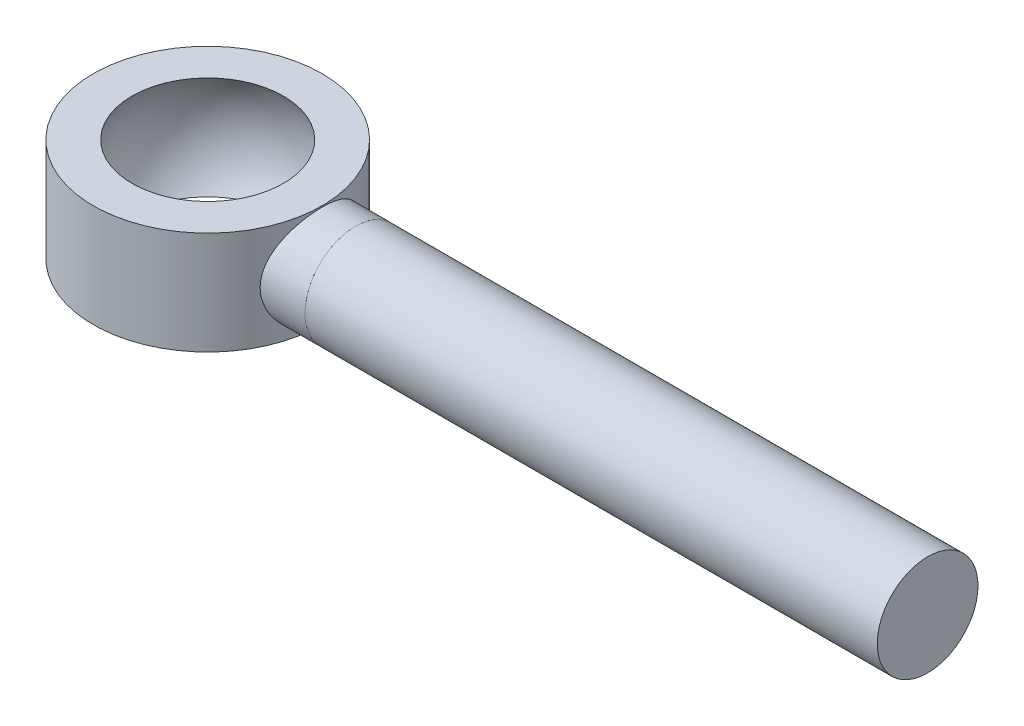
ISO-10303-21;
HEADER;
FILE_DESCRIPTION(('STEP AP214'),'2;1');
FILE_NAME('part.step','',(''),(''),'','','');
FILE_SCHEMA(('AUTOMOTIVE_DESIGN { 1 0 10303 214 1 1 1 1 }'));
ENDSEC;
DATA;
#1=APPLICATION_CONTEXT('core data for automotive mechanical design processes');
#2=APPLICATION_PROTOCOL_DEFINITION('international standard','automotive_design',2000,#1);
#3=PRODUCT_CONTEXT('',#1,'mechanical');
#4=PRODUCT('Part','Part','',(#3));
#5=PRODUCT_RELATED_PRODUCT_CATEGORY('part','',(#4));
#6=PRODUCT_DEFINITION_FORMATION('','',#4);
#7=PRODUCT_DEFINITION_CONTEXT('part definition',#1,'design');
#8=PRODUCT_DEFINITION('design','',#6,#7);
#9=PRODUCT_DEFINITION_SHAPE('','',#8);
#10=(LENGTH_UNIT() NAMED_UNIT(*) SI_UNIT(.MILLI.,.METRE.));
#11=(NAMED_UNIT(*) PLANE_ANGLE_UNIT() SI_UNIT($,.RADIAN.));
#12=(NAMED_UNIT(*) SI_UNIT($,.STERADIAN.) SOLID_ANGLE_UNIT());
#13=UNCERTAINTY_MEASURE_WITH_UNIT(LENGTH_MEASURE(1.E-05),#10,'distance_accuracy_value','');
#14=(GEOMETRIC_REPRESENTATION_CONTEXT(3) GLOBAL_UNCERTAINTY_ASSIGNED_CONTEXT((#13)) GLOBAL_UNIT_ASSIGNED_CONTEXT((#10,
#11,#12)) REPRESENTATION_CONTEXT('',''));
#15=CARTESIAN_POINT('',(0.,0.,0.));
#16=DIRECTION('',(0.,0.,1.));
#17=DIRECTION('',(1.,0.,0.));
#18=AXIS2_PLACEMENT_3D('',#15,#16,#17);
#19=CARTESIAN_POINT('',(-150.,0.,0.));
#20=DIRECTION('',(-1.,0.,0.));
#21=DIRECTION('',(0.,0.,1.));
#22=AXIS2_PLACEMENT_3D('',#19,#20,#21);
#23=CYLINDRICAL_SURFACE('',#22,22.);
#24=CARTESIAN_POINT('',(-150.,0.,0.));
#25=DIRECTION('',(1.,0.,0.));
#26=DIRECTION('',(0.,0.,-1.));
#27=AXIS2_PLACEMENT_3D('',#24,#25,#26);
#28=CIRCLE('',#27,22.);
#29=CARTESIAN_POINT('',(-150.,0.,-22.));
#30=VERTEX_POINT('',#29);
#31=EDGE_CURVE('E12',#30,#30,#28,.T.);
#32=ORIENTED_EDGE('',*,*,#31,.F.);
#33=EDGE_LOOP('',(#32));
#34=FACE_BOUND('',#33,.T.);
#35=CARTESIAN_POINT('',(-400.,0.,0.));
#36=DIRECTION('',(1.,0.,0.));
#37=DIRECTION('',(0.,0.,-1.));
#38=AXIS2_PLACEMENT_3D('',#35,#36,#37);
#39=CIRCLE('',#38,22.);
#40=CARTESIAN_POINT('',(-400.,0.,-22.));
#41=VERTEX_POINT('',#40);
#42=EDGE_CURVE('E47',#41,#41,#39,.T.);
#43=ORIENTED_EDGE('',*,*,#42,.T.);
#44=EDGE_LOOP('',(#43));
#45=FACE_BOUND('',#44,.T.);
#46=ADVANCED_FACE('F44',(#34,#45),#23,.T.);
#47=CARTESIAN_POINT('',(-150.,0.,0.));
#48=DIRECTION('',(1.,0.,0.));
#49=DIRECTION('',(0.,0.,-1.));
#50=AXIS2_PLACEMENT_3D('',#47,#48,#49);
#51=PLANE('',#50);
#52=ORIENTED_EDGE('',*,*,#31,.T.);
#53=EDGE_LOOP('',(#52));
#54=FACE_BOUND('',#53,.T.);
#55=ADVANCED_FACE('F59',(#54),#51,.T.);
#56=CARTESIAN_POINT('',(-400.,0.,0.));
#57=DIRECTION('',(1.,0.,0.));
#58=DIRECTION('',(0.,0.,-1.));
#59=AXIS2_PLACEMENT_3D('',#56,#57,#58);
#60=PLANE('',#59);
#61=ORIENTED_EDGE('',*,*,#42,.F.);
#62=EDGE_LOOP('',(#61));
#63=FACE_BOUND('',#62,.T.);
#64=ADVANCED_FACE('F57',(#63),#60,.F.);
#65=CLOSED_SHELL('',(#46,#55,#64));
#66=MANIFOLD_SOLID_BREP('B2',#65);
#67=CARTESIAN_POINT('',(-464.5,-22.5,0.));
#68=DIRECTION('',(0.,-1.,0.));
#69=DIRECTION('',(0.,0.,-1.));
#70=AXIS2_PLACEMENT_3D('',#67,#68,#69);
#71=CYLINDRICAL_SURFACE('',#70,50.);
#72=CARTESIAN_POINT('',(-464.5,-22.5,0.));
#73=DIRECTION('',(0.,-1.,0.));
#74=DIRECTION('',(0.,0.,-1.));
#75=AXIS2_PLACEMENT_3D('',#72,#73,#74);
#76=CIRCLE('',#75,50.);
#77=CARTESIAN_POINT('',(-464.5,-22.5,-50.));
#78=VERTEX_POINT('',#77);
#79=EDGE_CURVE('E106',#78,#78,#76,.T.);
#80=ORIENTED_EDGE('',*,*,#79,.F.);
#81=EDGE_LOOP('',(#80));
#82=FACE_BOUND('',#81,.T.);
#83=CARTESIAN_POINT('',(-464.5,22.5,0.));
#84=DIRECTION('',(0.,-1.,0.));
#85=DIRECTION('',(0.,0.,-1.));
#86=AXIS2_PLACEMENT_3D('',#83,#84,#85);
#87=CIRCLE('',#86,50.);
#88=CARTESIAN_POINT('',(-464.5,22.5,-50.));
#89=VERTEX_POINT('',#88);
#90=EDGE_CURVE('E111',#89,#89,#87,.T.);
#91=ORIENTED_EDGE('',*,*,#90,.T.);
#92=EDGE_LOOP('',(#91));
#93=FACE_BOUND('',#92,.T.);
#94=CARTESIAN_POINT('',(-419.600111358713,0.,-22.));
#95=CARTESIAN_POINT('',(-419.600103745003,0.36821249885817,-21.9999835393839));
#96=CARTESIAN_POINT('',(-419.595464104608,0.736402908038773,-21.9906181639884));
#97=CARTESIAN_POINT('',(-419.577236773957,1.47086978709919,-21.9535091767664));
#98=CARTESIAN_POINT('',(-419.563667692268,1.83714864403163,-21.9258037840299));
#99=CARTESIAN_POINT('',(-419.527962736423,2.56607773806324,-21.8524711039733));
#100=CARTESIAN_POINT('',(-419.50585952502,2.92873646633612,-21.806912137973));
#101=CARTESIAN_POINT('',(-419.453408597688,3.64870124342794,-21.6982075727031));
#102=CARTESIAN_POINT('',(-419.423108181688,4.0060259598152,-21.6351628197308));
#103=CARTESIAN_POINT('',(-419.354647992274,4.71482595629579,-21.4919367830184));
#104=CARTESIAN_POINT('',(-419.316522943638,5.06631990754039,-21.4118311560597));
#105=CARTESIAN_POINT('',(-419.23294879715,5.76418120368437,-21.2347100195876));
#106=CARTESIAN_POINT('',(-419.187498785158,6.11054790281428,-21.137692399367));
#107=CARTESIAN_POINT('',(-419.089669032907,6.79819116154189,-20.9266974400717));
#108=CARTESIAN_POINT('',(-419.037269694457,7.13945016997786,-20.8126720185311));
#109=CARTESIAN_POINT('',(-418.925971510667,7.8169339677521,-20.5676832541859));
#110=CARTESIAN_POINT('',(-418.867038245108,8.15312036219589,-20.436629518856));
#111=CARTESIAN_POINT('',(-418.743492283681,8.81847745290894,-20.1585040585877));
#112=CARTESIAN_POINT('',(-418.678869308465,9.14763405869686,-20.0114032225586));
#113=CARTESIAN_POINT('',(-418.54495097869,9.79666794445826,-19.7021554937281));
#114=CARTESIAN_POINT('',(-418.47566907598,10.1165684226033,-19.5400514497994));
#115=CARTESIAN_POINT('',(-418.33312149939,10.746807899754,-19.2010801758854));
#116=CARTESIAN_POINT('',(-418.259862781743,11.0571621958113,-19.0242384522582));
#117=CARTESIAN_POINT('',(-418.110054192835,11.668037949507,-18.6560894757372));
#118=CARTESIAN_POINT('',(-418.033506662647,11.9685661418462,-18.4647924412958));
#119=CARTESIAN_POINT('',(-417.877809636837,12.5595160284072,-18.0680235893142));
#120=CARTESIAN_POINT('',(-417.798659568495,12.8499354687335,-17.8625486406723));
#121=CARTESIAN_POINT('',(-417.638445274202,13.420395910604,-17.4377148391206));
#122=CARTESIAN_POINT('',(-417.557379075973,13.7004253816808,-17.2183412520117));
#123=CARTESIAN_POINT('',(-417.394019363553,14.2498314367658,-16.7659956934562));
#124=CARTESIAN_POINT('',(-417.311723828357,14.5191870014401,-16.5329989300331));
#125=CARTESIAN_POINT('',(-417.146588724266,15.0469804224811,-16.0537033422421));
#126=CARTESIAN_POINT('',(-417.063748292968,15.3053876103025,-15.8073710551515));
#127=CARTESIAN_POINT('',(-416.898590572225,15.8098342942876,-15.3028036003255));
#128=CARTESIAN_POINT('',(-416.816272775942,16.0558882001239,-15.0445830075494));
#129=CARTESIAN_POINT('',(-416.65309878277,16.5343287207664,-14.5173230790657));
#130=CARTESIAN_POINT('',(-416.572238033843,16.76676639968,-14.2483315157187));
#131=CARTESIAN_POINT('',(-416.412489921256,17.2180845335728,-13.6994880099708));
#132=CARTESIAN_POINT('',(-416.333599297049,17.4369884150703,-13.4196562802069));
#133=CARTESIAN_POINT('',(-416.178279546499,17.8614330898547,-12.8491451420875));
#134=CARTESIAN_POINT('',(-416.101851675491,18.0669671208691,-12.5584603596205));
#135=CARTESIAN_POINT('',(-415.951944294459,18.4647515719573,-11.965680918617));
#136=CARTESIAN_POINT('',(-415.878477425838,18.6569471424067,-11.6635462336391));
#137=CARTESIAN_POINT('',(-415.735155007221,19.0273619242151,-11.0485368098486));
#138=CARTESIAN_POINT('',(-415.66531259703,19.2055313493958,-10.7356290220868));
#139=CARTESIAN_POINT('',(-415.530083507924,19.5468398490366,-10.1008179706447));
#140=CARTESIAN_POINT('',(-415.464696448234,19.7099802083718,-9.77891547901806));
#141=CARTESIAN_POINT('',(-415.339187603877,20.0201228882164,-9.12782437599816));
#142=CARTESIAN_POINT('',(-415.279048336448,20.1671792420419,-8.79866492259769));
#143=CARTESIAN_POINT('',(-415.164804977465,20.4445682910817,-8.13313853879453));
#144=CARTESIAN_POINT('',(-415.11068895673,20.5749341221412,-7.7967874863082));
#145=CARTESIAN_POINT('',(-415.008718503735,20.8191808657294,-7.11674244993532));
#146=CARTESIAN_POINT('',(-414.960871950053,20.9330410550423,-6.77303984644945));
#147=CARTESIAN_POINT('',(-414.87170205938,21.1440085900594,-6.07946263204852));
#148=CARTESIAN_POINT('',(-414.830382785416,21.2411055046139,-5.72958432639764));
#149=CARTESIAN_POINT('',(-414.754591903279,21.4182360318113,-5.02480456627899));
#150=CARTESIAN_POINT('',(-414.720120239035,21.4982697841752,-4.66990315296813));
#151=CARTESIAN_POINT('',(-414.658331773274,21.6409749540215,-3.9562334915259));
#152=CARTESIAN_POINT('',(-414.63101063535,21.7036568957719,-3.59746772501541));
#153=CARTESIAN_POINT('',(-414.583838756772,21.8113542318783,-2.87722491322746));
#154=CARTESIAN_POINT('',(-414.563979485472,21.8563898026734,-2.51575144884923));
#155=CARTESIAN_POINT('',(-414.532031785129,21.9285004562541,-1.79125193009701));
#156=CARTESIAN_POINT('',(-414.519931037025,21.9556040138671,-1.42822926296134));
#157=CARTESIAN_POINT('',(-414.503852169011,21.9915252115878,-0.701785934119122));
#158=CARTESIAN_POINT('',(-414.499858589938,22.0003776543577,-0.338367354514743));
#159=CARTESIAN_POINT('',(-414.500154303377,21.999592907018,0.389317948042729));
#160=CARTESIAN_POINT('',(-414.504463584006,21.9899110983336,0.753584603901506));
#161=CARTESIAN_POINT('',(-414.52096819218,21.952496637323,1.48268950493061));
#162=CARTESIAN_POINT('',(-414.533199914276,21.9246806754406,1.84752259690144));
#163=CARTESIAN_POINT('',(-414.565416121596,21.8511506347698,2.57549285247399));
#164=CARTESIAN_POINT('',(-414.585410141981,21.8054145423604,2.9386273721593));
#165=CARTESIAN_POINT('',(-414.63301934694,21.6961077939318,3.66089675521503));
#166=CARTESIAN_POINT('',(-414.660617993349,21.6325758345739,4.02003855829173));
#167=CARTESIAN_POINT('',(-414.723138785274,21.4881374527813,4.73233559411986));
#168=CARTESIAN_POINT('',(-414.758024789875,21.4073167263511,5.08551140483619));
#169=CARTESIAN_POINT('',(-414.834588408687,21.2289066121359,5.78554223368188));
#170=CARTESIAN_POINT('',(-414.876242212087,21.1313759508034,6.13241483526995));
#171=CARTESIAN_POINT('',(-414.966044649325,20.9196150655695,6.81990252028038));
#172=CARTESIAN_POINT('',(-415.014188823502,20.8053963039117,7.16052171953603));
#173=CARTESIAN_POINT('',(-415.116590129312,20.5605540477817,7.83565111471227));
#174=CARTESIAN_POINT('',(-415.170859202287,20.4298984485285,8.17014784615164));
#175=CARTESIAN_POINT('',(-415.285311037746,20.1519494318,8.8331927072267));
#176=CARTESIAN_POINT('',(-415.345522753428,20.0045739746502,9.16170144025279));
#177=CARTESIAN_POINT('',(-415.471232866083,19.6936842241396,9.81160513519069));
#178=CARTESIAN_POINT('',(-415.536751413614,19.5301078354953,10.1329664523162));
#179=CARTESIAN_POINT('',(-415.672188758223,19.188027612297,10.7666951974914));
#180=CARTESIAN_POINT('',(-415.742107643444,19.0095234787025,11.0790624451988));
#181=CARTESIAN_POINT('',(-415.885514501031,18.6385935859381,11.6927911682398));
#182=CARTESIAN_POINT('',(-415.958986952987,18.44622683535,11.9941919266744));
#183=CARTESIAN_POINT('',(-416.108835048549,18.0482539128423,12.5853289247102));
#184=CARTESIAN_POINT('',(-416.185196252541,17.8427107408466,12.8751112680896));
#185=CARTESIAN_POINT('',(-416.340339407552,17.4183568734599,13.443804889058));
#186=CARTESIAN_POINT('',(-416.419119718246,17.1995550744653,13.7227232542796));
#187=CARTESIAN_POINT('',(-416.578606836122,16.7485432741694,14.269719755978));
#188=CARTESIAN_POINT('',(-416.659316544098,16.5163122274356,14.537779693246));
#189=CARTESIAN_POINT('',(-416.822151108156,16.0384241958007,15.0631899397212));
#190=CARTESIAN_POINT('',(-416.904280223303,15.7927188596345,15.3204949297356));
#191=CARTESIAN_POINT('',(-417.069131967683,15.2886644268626,15.8234869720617));
#192=CARTESIAN_POINT('',(-417.151855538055,15.0302869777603,16.0691453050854));
#193=CARTESIAN_POINT('',(-417.316899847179,14.501972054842,16.5475300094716));
#194=CARTESIAN_POINT('',(-417.399220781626,14.2320409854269,16.7802633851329));
#195=CARTESIAN_POINT('',(-417.56272581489,13.6811163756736,17.2324055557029));
#196=CARTESIAN_POINT('',(-417.643910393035,13.4001277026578,17.4518201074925));
#197=CARTESIAN_POINT('',(-417.804404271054,12.8275589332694,17.8769072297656));
#198=CARTESIAN_POINT('',(-417.883714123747,12.5359820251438,18.0825838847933));
#199=CARTESIAN_POINT('',(-418.039721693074,11.9427153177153,18.4797854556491));
#200=CARTESIAN_POINT('',(-418.116419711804,11.6410266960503,18.6713120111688));
#201=CARTESIAN_POINT('',(-418.266466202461,11.0280125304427,19.0398004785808));
#202=CARTESIAN_POINT('',(-418.339814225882,10.7166857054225,19.2167604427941));
#203=CARTESIAN_POINT('',(-418.482426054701,10.0848757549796,19.5557124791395));
#204=CARTESIAN_POINT('',(-418.551687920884,9.76438838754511,19.7176974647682));
#205=CARTESIAN_POINT('',(-418.685385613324,9.11472445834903,20.0262677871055));
#206=CARTESIAN_POINT('',(-418.749816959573,8.78554020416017,20.1728388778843));
#207=CARTESIAN_POINT('',(-418.872931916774,8.12013993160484,20.4497899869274));
#208=CARTESIAN_POINT('',(-418.931626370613,7.78393869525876,20.5802006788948));
#209=CARTESIAN_POINT('',(-419.042559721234,7.10576527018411,20.8242015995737));
#210=CARTESIAN_POINT('',(-419.094820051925,6.76381680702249,20.9378479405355));
#211=CARTESIAN_POINT('',(-419.192426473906,6.07407134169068,21.1482337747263));
#212=CARTESIAN_POINT('',(-419.237777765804,5.72627895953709,21.2449859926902));
#213=CARTESIAN_POINT('',(-419.321182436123,5.02480870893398,21.4216535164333));
#214=CARTESIAN_POINT('',(-419.359220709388,4.67112026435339,21.5015340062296));
#215=CARTESIAN_POINT('',(-419.427346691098,3.95809714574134,21.6439939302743));
#216=CARTESIAN_POINT('',(-419.457403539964,3.59874608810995,21.7065062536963));
#217=CARTESIAN_POINT('',(-419.509161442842,2.87624488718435,21.8137335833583));
#218=CARTESIAN_POINT('',(-419.530849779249,2.51308981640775,21.8584215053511));
#219=CARTESIAN_POINT('',(-419.565628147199,1.78525376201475,21.9298394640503));
#220=CARTESIAN_POINT('',(-419.57873317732,1.42057656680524,21.9566008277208));
#221=CARTESIAN_POINT('',(-419.596118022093,0.691945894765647,21.9919368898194));
#222=CARTESIAN_POINT('',(-419.600441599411,0.327997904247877,22.0006017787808));
#223=CARTESIAN_POINT('',(-419.59975320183,-0.398975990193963,21.9993410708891));
#224=CARTESIAN_POINT('',(-419.594763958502,-0.762001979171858,21.98946074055));
#225=CARTESIAN_POINT('',(-419.575760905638,-1.48760574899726,21.9514754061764));
#226=CARTESIAN_POINT('',(-419.561728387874,-1.85018103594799,21.9233326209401));
#227=CARTESIAN_POINT('',(-419.525156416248,-2.57365096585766,21.8492140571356));
#228=CARTESIAN_POINT('',(-419.502603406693,-2.93454199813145,21.8032098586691));
#229=CARTESIAN_POINT('',(-419.44942654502,-3.65340233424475,21.6937012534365));
#230=CARTESIAN_POINT('',(-419.418795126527,-4.01136857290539,21.6301804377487));
#231=CARTESIAN_POINT('',(-419.349919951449,-4.72313911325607,21.4859851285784));
#232=CARTESIAN_POINT('',(-419.31167509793,-5.0769428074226,21.4053081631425));
#233=CARTESIAN_POINT('',(-419.228018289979,-5.77914194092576,21.2271350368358));
#234=CARTESIAN_POINT('',(-419.182611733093,-6.12754123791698,21.1296515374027));
#235=CARTESIAN_POINT('',(-419.085104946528,-6.81769645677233,20.9182228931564));
#236=CARTESIAN_POINT('',(-419.033016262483,-7.15946269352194,20.8043061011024));
#237=CARTESIAN_POINT('',(-418.922519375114,-7.83506542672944,20.5602810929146));
#238=CARTESIAN_POINT('',(-418.864128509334,-8.16892074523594,20.4302171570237));
#239=CARTESIAN_POINT('',(-418.741474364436,-8.82919214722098,20.1538211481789));
#240=CARTESIAN_POINT('',(-418.677204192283,-9.15559892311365,20.0074699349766));
#241=CARTESIAN_POINT('',(-418.543663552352,-9.80157363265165,19.6988628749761));
#242=CARTESIAN_POINT('',(-418.474372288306,-10.1211050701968,19.5365397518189));
#243=CARTESIAN_POINT('',(-418.331561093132,-10.751979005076,19.1966009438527));
#244=CARTESIAN_POINT('',(-418.258031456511,-11.0633001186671,19.0189496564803));
#245=CARTESIAN_POINT('',(-418.107594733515,-11.676402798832,18.6489838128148));
#246=CARTESIAN_POINT('',(-418.030686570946,-11.9781812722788,18.45666456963));
#247=CARTESIAN_POINT('',(-417.874495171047,-12.5706511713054,18.0584667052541));
#248=CARTESIAN_POINT('',(-417.795219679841,-12.8613729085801,17.8526301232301));
#249=CARTESIAN_POINT('',(-417.635127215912,-13.4312157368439,17.4280846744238));
#250=CARTESIAN_POINT('',(-417.554316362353,-13.7103727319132,17.2094216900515));
#251=CARTESIAN_POINT('',(-417.39171001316,-14.2572125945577,16.7591768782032));
#252=CARTESIAN_POINT('',(-417.309915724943,-14.5249079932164,16.5276098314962));
#253=CARTESIAN_POINT('',(-417.145911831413,-15.0490779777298,16.0516509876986));
#254=CARTESIAN_POINT('',(-417.063701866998,-15.3055398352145,15.8072452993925));
#255=CARTESIAN_POINT('',(-416.899374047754,-15.8074306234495,15.3051806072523));
#256=CARTESIAN_POINT('',(-416.817257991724,-16.0528093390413,15.0474708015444));
#257=CARTESIAN_POINT('',(-416.653876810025,-16.5317660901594,14.519342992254));
#258=CARTESIAN_POINT('',(-416.572615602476,-16.7653004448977,14.2488841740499));
#259=CARTESIAN_POINT('',(-416.411905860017,-17.2193516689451,13.6967128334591));
#260=CARTESIAN_POINT('',(-416.332457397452,-17.4398680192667,13.4149998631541));
#261=CARTESIAN_POINT('',(-416.176362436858,-17.8665039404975,12.8416404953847));
#262=CARTESIAN_POINT('',(-416.099707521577,-18.0726688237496,12.550030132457));
#263=CARTESIAN_POINT('',(-415.949913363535,-18.4701280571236,11.9576008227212));
#264=CARTESIAN_POINT('',(-415.876762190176,-18.6614744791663,11.6568198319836));
#265=CARTESIAN_POINT('',(-415.734298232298,-19.0296646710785,11.0457545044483));
#266=CARTESIAN_POINT('',(-415.664984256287,-19.2065129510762,10.7354731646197));
#267=CARTESIAN_POINT('',(-415.530671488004,-19.5455060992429,10.1051776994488));
#268=CARTESIAN_POINT('',(-415.465682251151,-19.7076186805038,9.7851441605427));
#269=CARTESIAN_POINT('',(-415.340459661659,-20.0170613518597,9.13519118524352));
#270=CARTESIAN_POINT('',(-415.280250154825,-20.1643182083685,8.80523228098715));
#271=CARTESIAN_POINT('',(-415.165449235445,-20.4429492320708,8.13731265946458));
#272=CARTESIAN_POINT('',(-415.110863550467,-20.5743072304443,7.79934420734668));
#273=CARTESIAN_POINT('',(-415.008079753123,-20.8199377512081,7.11776141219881));
#274=CARTESIAN_POINT('',(-414.95985838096,-20.9342726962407,6.77417309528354));
#275=CARTESIAN_POINT('',(-414.870129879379,-21.1457354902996,6.08192285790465));
#276=CARTESIAN_POINT('',(-414.828604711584,-21.242909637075,5.73327742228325));
#277=CARTESIAN_POINT('',(-414.752568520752,-21.419993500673,5.03148989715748));
#278=CARTESIAN_POINT('',(-414.718045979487,-21.4999315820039,4.67835622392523));
#279=CARTESIAN_POINT('',(-414.656356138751,-21.6423881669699,3.96688706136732));
#280=CARTESIAN_POINT('',(-414.62921029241,-21.7048558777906,3.608539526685));
#281=CARTESIAN_POINT('',(-414.582425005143,-21.8122424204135,2.88719534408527));
#282=CARTESIAN_POINT('',(-414.562817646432,-21.857086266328,2.52418547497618));
#283=CARTESIAN_POINT('',(-414.531322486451,-21.9289494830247,1.79587774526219));
#284=CARTESIAN_POINT('',(-414.519438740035,-21.9559594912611,1.4305787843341));
#285=CARTESIAN_POINT('',(-414.503701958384,-21.9916561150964,0.700038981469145));
#286=CARTESIAN_POINT('',(-414.499824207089,-22.0003991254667,0.334801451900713));
#287=CARTESIAN_POINT('',(-414.500193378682,-21.9995609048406,-0.393821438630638));
#288=CARTESIAN_POINT('',(-414.504399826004,-21.9900709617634,-0.757206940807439));
#289=CARTESIAN_POINT('',(-414.520645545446,-21.9532167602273,-1.48193969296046));
#290=CARTESIAN_POINT('',(-414.532664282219,-21.9258993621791,-1.84328978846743));
#291=CARTESIAN_POINT('',(-414.564454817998,-21.8533532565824,-2.56395163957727));
#292=CARTESIAN_POINT('',(-414.584228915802,-21.8081192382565,-2.92326275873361));
#293=CARTESIAN_POINT('',(-414.631351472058,-21.6999421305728,-3.63987978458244));
#294=CARTESIAN_POINT('',(-414.658723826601,-21.6369431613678,-3.99717567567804));
#295=CARTESIAN_POINT('',(-414.72100333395,-21.4930783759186,-4.709213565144));
#296=CARTESIAN_POINT('',(-414.755944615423,-21.4121315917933,-5.06393621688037));
#297=CARTESIAN_POINT('',(-414.832905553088,-21.2327943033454,-5.76891430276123));
#298=CARTESIAN_POINT('',(-414.87493911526,-21.1343695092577,-6.11915947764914));
#299=CARTESIAN_POINT('',(-414.965458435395,-20.920938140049,-6.81316311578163));
#300=CARTESIAN_POINT('',(-415.013935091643,-20.8059549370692,-7.15692996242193));
#301=CARTESIAN_POINT('',(-415.116743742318,-20.5601497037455,-7.8359228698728));
#302=CARTESIAN_POINT('',(-415.171045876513,-20.4294080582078,-8.17118253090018));
#303=CARTESIAN_POINT('',(-415.285284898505,-20.1520500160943,-8.83308930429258));
#304=CARTESIAN_POINT('',(-415.345207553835,-20.0054735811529,-9.1597556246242));
#305=CARTESIAN_POINT('',(-415.470254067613,-19.6965471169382,-9.80539740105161));
#306=CARTESIAN_POINT('',(-415.53538879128,-19.5341639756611,-10.1243548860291));
#307=CARTESIAN_POINT('',(-415.670155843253,-19.1942207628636,-10.7538104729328));
#308=CARTESIAN_POINT('',(-415.739795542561,-19.0166356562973,-11.0642934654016));
#309=CARTESIAN_POINT('',(-415.882881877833,-18.6468894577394,-11.6760264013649));
#310=CARTESIAN_POINT('',(-415.956332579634,-18.4547126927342,-11.9772659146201));
#311=CARTESIAN_POINT('',(-416.106345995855,-18.0563818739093,-12.5697378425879));
#312=CARTESIAN_POINT('',(-416.182909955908,-17.8502222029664,-12.8609661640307));
#313=CARTESIAN_POINT('',(-416.338457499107,-17.4245217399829,-13.432636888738));
#314=CARTESIAN_POINT('',(-416.417440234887,-17.2049856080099,-13.7130829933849));
#315=CARTESIAN_POINT('',(-416.577123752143,-16.7531367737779,-14.2624195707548));
#316=CARTESIAN_POINT('',(-416.657822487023,-16.5208388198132,-14.5313227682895));
#317=CARTESIAN_POINT('',(-416.820265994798,-16.0440386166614,-15.0567631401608));
#318=CARTESIAN_POINT('',(-416.902008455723,-15.79956071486,-15.3133231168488));
#319=CARTESIAN_POINT('',(-417.06604697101,-15.2981962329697,-15.814309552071));
#320=CARTESIAN_POINT('',(-417.14834345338,-15.0412988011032,-16.0587250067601));
#321=CARTESIAN_POINT('',(-417.312849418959,-14.5151088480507,-16.535731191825));
#322=CARTESIAN_POINT('',(-417.395057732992,-14.2457784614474,-16.7682805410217));
#323=CARTESIAN_POINT('',(-417.558548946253,-13.6954912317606,-17.2206835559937));
#324=CARTESIAN_POINT('',(-417.639829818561,-13.4145135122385,-17.4405125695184));
#325=CARTESIAN_POINT('',(-417.800593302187,-12.8416953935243,-17.8665894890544));
#326=CARTESIAN_POINT('',(-417.880074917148,-12.5498492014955,-18.0728299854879));
#327=CARTESIAN_POINT('',(-418.036233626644,-11.9567542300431,-18.4706561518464));
#328=CARTESIAN_POINT('',(-418.112917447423,-11.655531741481,-18.6622783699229));
#329=CARTESIAN_POINT('',(-418.262681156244,-11.0445331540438,-19.0303689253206));
#330=CARTESIAN_POINT('',(-418.335772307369,-10.7347892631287,-19.2068861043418));
#331=CARTESIAN_POINT('',(-418.477783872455,-10.106607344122,-19.5447227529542));
#332=CARTESIAN_POINT('',(-418.546708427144,-9.78817841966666,-19.7060574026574));
#333=CARTESIAN_POINT('',(-418.679872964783,-9.14257558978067,-20.0136518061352));
#334=CARTESIAN_POINT('',(-418.744106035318,-8.81538971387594,-20.1598894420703));
#335=CARTESIAN_POINT('',(-418.867206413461,-8.15199624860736,-20.4370043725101));
#336=CARTESIAN_POINT('',(-418.926051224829,-7.81575780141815,-20.5678178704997));
#337=CARTESIAN_POINT('',(-419.037618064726,-7.13548642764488,-20.813339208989));
#338=CARTESIAN_POINT('',(-419.090324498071,-6.79143619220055,-20.9280061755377));
#339=CARTESIAN_POINT('',(-419.188890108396,-6.09763135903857,-21.1405691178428));
#340=CARTESIAN_POINT('',(-419.234756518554,-5.74788322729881,-21.2384828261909));
#341=CARTESIAN_POINT('',(-419.318820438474,-5.04469598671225,-21.4166470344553));
#342=CARTESIAN_POINT('',(-419.357051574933,-4.69128061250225,-21.4969751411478));
#343=CARTESIAN_POINT('',(-419.425330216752,-3.98158589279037,-21.6397998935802));
#344=CARTESIAN_POINT('',(-419.455410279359,-3.62532397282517,-21.7023675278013));
#345=CARTESIAN_POINT('',(-419.50735303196,-2.90936450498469,-21.8099951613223));
#346=CARTESIAN_POINT('',(-419.529211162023,-2.54966516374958,-21.8550454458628));
#347=CARTESIAN_POINT('',(-419.564412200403,-1.82675934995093,-21.927335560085));
#348=CARTESIAN_POINT('',(-419.577724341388,-1.46354493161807,-21.954511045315));
#349=CARTESIAN_POINT('',(-419.595613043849,-0.73355791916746,-21.9909218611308));
#350=CARTESIAN_POINT('',(-419.600130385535,-0.366777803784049,-22.0000355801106));
#351=CARTESIAN_POINT('',(-419.600111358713,0.,-22.));
#352=B_SPLINE_CURVE_WITH_KNOTS('',3,(#94,#95,#96,#97,#98,#99,#100,#101,#102,#103,#104,#105,#106,
#107,#108,#109,#110,#111,#112,#113,#114,#115,#116,#117,#118,#119,#120,#121,#122,#123,#124,#125,
#126,#127,#128,#129,#130,#131,#132,#133,#134,#135,#136,#137,#138,#139,#140,#141,#142,#143,#144,
#145,#146,#147,#148,#149,#150,#151,#152,#153,#154,#155,#156,#157,#158,#159,#160,#161,#162,#163,
#164,#165,#166,#167,#168,#169,#170,#171,#172,#173,#174,#175,#176,#177,#178,#179,#180,#181,#182,
#183,#184,#185,#186,#187,#188,#189,#190,#191,#192,#193,#194,#195,#196,#197,#198,#199,#200,#201,
#202,#203,#204,#205,#206,#207,#208,#209,#210,#211,#212,#213,#214,#215,#216,#217,#218,#219,#220,
#221,#222,#223,#224,#225,#226,#227,#228,#229,#230,#231,#232,#233,#234,#235,#236,#237,#238,#239,
#240,#241,#242,#243,#244,#245,#246,#247,#248,#249,#250,#251,#252,#253,#254,#255,#256,#257,#258,
#259,#260,#261,#262,#263,#264,#265,#266,#267,#268,#269,#270,#271,#272,#273,#274,#275,#276,#277,
#278,#279,#280,#281,#282,#283,#284,#285,#286,#287,#288,#289,#290,#291,#292,#293,#294,#295,#296,
#297,#298,#299,#300,#301,#302,#303,#304,#305,#306,#307,#308,#309,#310,#311,#312,#313,#314,#315,
#316,#317,#318,#319,#320,#321,#322,#323,#324,#325,#326,#327,#328,#329,#330,#331,#332,#333,#334,
#335,#336,#337,#338,#339,#340,#341,#342,#343,#344,#345,#346,#347,#348,#349,#350,#351),
.UNSPECIFIED.,.F.,.F.,(4,2,2,2,2,2,2,2,2,2,2,2,2,2,2,2,2,2,2,2,2,2,2,2,2,2,2,2,2,2,2,2,2,2,2,2,
2,2,2,2,2,2,2,2,2,2,2,2,2,2,2,2,2,2,2,2,2,2,2,2,2,2,2,2,2,2,2,2,2,2,2,2,2,2,2,2,2,2,2,2,2,2,2,2,
2,2,2,2,2,2,2,2,2,2,2,2,2,2,2,2,2,2,2,2,2,2,2,2,2,2,2,2,2,2,2,2,2,2,2,2,2,2,2,2,2,2,2,2,4),(0.,
1.10445792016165,2.20662145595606,3.30460782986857,4.39638891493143,5.48342569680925,
6.57059824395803,7.66090471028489,8.75725537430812,9.85562908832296,10.9509573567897,
12.0444278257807,13.1371324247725,14.2300791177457,15.3242045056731,16.4203870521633,
17.5194607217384,18.6172210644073,19.7105592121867,20.8019485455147,21.8938856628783,
22.9900752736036,24.0899951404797,25.1898208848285,26.2858303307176,27.3796289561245,
28.4747891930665,29.5706284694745,30.6664587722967,31.7616229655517,32.8555312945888,
33.9476983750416,35.0377808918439,36.1304909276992,37.2282566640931,38.3273751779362,
39.4241219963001,40.5155535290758,41.6032251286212,42.690153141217,43.7792381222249,
44.8739190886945,45.9729713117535,47.0720455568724,48.1666901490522,49.2564434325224,
50.3454734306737,51.4362589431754,52.531253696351,53.6288213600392,54.7257883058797,
55.8222776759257,56.9184395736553,58.0144742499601,59.1106552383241,60.207352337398,
61.3050542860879,62.4006397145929,63.4924705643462,64.5834754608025,65.6767101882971,
66.7741122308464,67.8731754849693,68.9703130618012,70.06196946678,71.1509647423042,
72.2422201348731,73.3352190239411,74.429245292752,75.5234293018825,76.6167925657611,
77.7082914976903,78.7968607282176,79.8867229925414,80.9813902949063,82.0786723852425,
83.1763065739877,84.2706754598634,85.3613436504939,86.4507872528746,87.54143492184,
88.6366097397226,89.7355667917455,90.8345676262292,91.9299243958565,93.0212387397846,
94.1122122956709,95.2055213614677,96.3039806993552,97.4035479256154,98.4989781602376,
99.5914063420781,100.682022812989,101.775777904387,102.874137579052,103.973073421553,
105.068611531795,106.15867884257,107.245892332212,108.333428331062,109.424424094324,
110.520445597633,111.618641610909,112.715302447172,113.806588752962,114.895182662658,
115.986108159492,117.078866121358,118.172814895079,119.267205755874,120.361217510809,
121.453990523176,122.544660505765,123.636301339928,124.731520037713,125.828794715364,
126.926662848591,128.021689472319,129.113029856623,130.203267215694,131.295079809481,
132.391260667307,133.490168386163,134.587905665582,135.680696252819,136.76905539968,
137.858017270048,138.950877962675,140.051072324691),.UNSPECIFIED.);
#353=CARTESIAN_POINT('',(-419.600111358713,0.,-22.));
#354=VERTEX_POINT('',#353);
#355=EDGE_CURVE('E43',#354,#354,#352,.T.);
#356=ORIENTED_EDGE('',*,*,#355,.F.);
#357=EDGE_LOOP('',(#356));
#358=FACE_BOUND('',#357,.T.);
#359=ADVANCED_FACE('F91',(#82,#93,#358),#71,.T.);
#360=CARTESIAN_POINT('',(-464.5,0.,0.));
#361=DIRECTION('',(0.,-1.,0.));
#362=DIRECTION('',(-1.,0.,0.));
#363=AXIS2_PLACEMENT_3D('',#360,#361,#362);
#364=SPHERICAL_SURFACE('',#363,40.0000000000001);
#365=CARTESIAN_POINT('',(-464.5,22.5,0.));
#366=DIRECTION('',(0.,-1.,0.));
#367=DIRECTION('',(0.,0.,-1.));
#368=AXIS2_PLACEMENT_3D('',#365,#366,#367);
#369=CIRCLE('',#368,33.0718913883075);
#370=CARTESIAN_POINT('',(-497.571891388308,22.5,0.));
#371=VERTEX_POINT('',#370);
#372=EDGE_CURVE('E146',#371,#371,#369,.T.);
#373=CARTESIAN_POINT('',(-464.5,-22.5,0.));
#374=DIRECTION('',(0.,-1.,0.));
#375=DIRECTION('',(0.,0.,-1.));
#376=AXIS2_PLACEMENT_3D('',#373,#374,#375);
#377=CIRCLE('',#376,33.0718913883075);
#378=CARTESIAN_POINT('',(-497.571891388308,-22.5,0.));
#379=VERTEX_POINT('',#378);
#380=EDGE_CURVE('E101',#379,#379,#377,.T.);
#381=CARTESIAN_POINT('',(-497.571891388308,22.5,0.));
#382=CARTESIAN_POINT('',(-497.851929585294,22.0883908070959,0.));
#383=CARTESIAN_POINT('',(-498.124275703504,21.671548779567,0.));
#384=CARTESIAN_POINT('',(-498.65322145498,20.827990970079,0.));
#385=CARTESIAN_POINT('',(-498.909821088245,20.4012751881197,0.));
#386=CARTESIAN_POINT('',(-499.406911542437,19.5385617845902,0.));
#387=CARTESIAN_POINT('',(-499.647402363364,19.1025641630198,0.));
#388=CARTESIAN_POINT('',(-500.11194120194,18.2218956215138,0.));
#389=CARTESIAN_POINT('',(-500.33598921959,17.7772247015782,0.));
#390=CARTESIAN_POINT('',(-500.767329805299,16.8798292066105,0.));
#391=CARTESIAN_POINT('',(-500.974622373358,16.4271046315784,0.));
#392=CARTESIAN_POINT('',(-501.372163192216,15.5142329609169,0.));
#393=CARTESIAN_POINT('',(-501.562411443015,15.0540858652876,0.));
#394=CARTESIAN_POINT('',(-501.925598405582,14.1270105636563,0.));
#395=CARTESIAN_POINT('',(-502.098537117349,13.6600823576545,0.));
#396=CARTESIAN_POINT('',(-502.426863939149,12.7200957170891,0.));
#397=CARTESIAN_POINT('',(-502.582252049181,12.2470372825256,0.));
#398=CARTESIAN_POINT('',(-502.875261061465,11.2954496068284,0.));
#399=CARTESIAN_POINT('',(-503.012881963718,10.8169203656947,0.));
#400=CARTESIAN_POINT('',(-503.270164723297,9.85505812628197,0.));
#401=CARTESIAN_POINT('',(-503.389826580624,9.37172512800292,0.));
#402=CARTESIAN_POINT('',(-503.611024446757,8.40092911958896,0.));
#403=CARTESIAN_POINT('',(-503.712560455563,7.91346610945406,0.));
#404=CARTESIAN_POINT('',(-503.897365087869,6.93508957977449,0.));
#405=CARTESIAN_POINT('',(-503.980633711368,6.44417606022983,0.));
#406=CARTESIAN_POINT('',(-504.128787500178,5.4595828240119,0.));
#407=CARTESIAN_POINT('',(-504.19367266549,4.96590310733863,0.));
#408=CARTESIAN_POINT('',(-504.304969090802,3.9764656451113,0.));
#409=CARTESIAN_POINT('',(-504.351380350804,3.48070789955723,0.));
#410=CARTESIAN_POINT('',(-504.425664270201,2.48780544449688,0.));
#411=CARTESIAN_POINT('',(-504.453536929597,1.99066073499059,0.));
#412=CARTESIAN_POINT('',(-504.490704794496,0.995677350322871,0.));
#413=CARTESIAN_POINT('',(-504.5,0.497838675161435,0.));
#414=CARTESIAN_POINT('',(-504.5,-0.497838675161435,0.));
#415=CARTESIAN_POINT('',(-504.490704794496,-0.995677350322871,0.));
#416=CARTESIAN_POINT('',(-504.453536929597,-1.99066073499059,0.));
#417=CARTESIAN_POINT('',(-504.425664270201,-2.48780544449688,0.));
#418=CARTESIAN_POINT('',(-504.351380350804,-3.48070789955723,0.));
#419=CARTESIAN_POINT('',(-504.304969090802,-3.9764656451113,0.));
#420=CARTESIAN_POINT('',(-504.19367266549,-4.96590310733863,0.));
#421=CARTESIAN_POINT('',(-504.128787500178,-5.4595828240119,0.));
#422=CARTESIAN_POINT('',(-503.980633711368,-6.44417606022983,0.));
#423=CARTESIAN_POINT('',(-503.897365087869,-6.93508957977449,0.));
#424=CARTESIAN_POINT('',(-503.712560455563,-7.91346610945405,0.));
#425=CARTESIAN_POINT('',(-503.611024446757,-8.40092911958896,0.));
#426=CARTESIAN_POINT('',(-503.389826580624,-9.37172512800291,0.));
#427=CARTESIAN_POINT('',(-503.270164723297,-9.85505812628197,0.));
#428=CARTESIAN_POINT('',(-503.012881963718,-10.8169203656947,0.));
#429=CARTESIAN_POINT('',(-502.875261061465,-11.2954496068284,0.));
#430=CARTESIAN_POINT('',(-502.582252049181,-12.2470372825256,0.));
#431=CARTESIAN_POINT('',(-502.426863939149,-12.7200957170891,0.));
#432=CARTESIAN_POINT('',(-502.098537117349,-13.6600823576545,0.));
#433=CARTESIAN_POINT('',(-501.925598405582,-14.1270105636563,0.));
#434=CARTESIAN_POINT('',(-501.562411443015,-15.0540858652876,0.));
#435=CARTESIAN_POINT('',(-501.372163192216,-15.5142329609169,0.));
#436=CARTESIAN_POINT('',(-500.974622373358,-16.4271046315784,0.));
#437=CARTESIAN_POINT('',(-500.767329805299,-16.8798292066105,0.));
#438=CARTESIAN_POINT('',(-500.33598921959,-17.7772247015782,0.));
#439=CARTESIAN_POINT('',(-500.11194120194,-18.2218956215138,0.));
#440=CARTESIAN_POINT('',(-499.647402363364,-19.1025641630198,0.));
#441=CARTESIAN_POINT('',(-499.406911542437,-19.5385617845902,0.));
#442=CARTESIAN_POINT('',(-498.909821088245,-20.4012751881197,0.));
#443=CARTESIAN_POINT('',(-498.65322145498,-20.827990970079,0.));
#444=CARTESIAN_POINT('',(-498.124275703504,-21.671548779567,0.));
#445=CARTESIAN_POINT('',(-497.851929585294,-22.0883908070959,0.));
#446=CARTESIAN_POINT('',(-497.571891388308,-22.5,0.));
#447=B_SPLINE_CURVE_WITH_KNOTS('',3,(#381,#382,#383,#384,#385,#386,#387,#388,#389,#390,#391,
#392,#393,#394,#395,#396,#397,#398,#399,#400,#401,#402,#403,#404,#405,#406,#407,#408,#409,#410,
#411,#412,#413,#414,#415,#416,#417,#418,#419,#420,#421,#422,#423,#424,#425,#426,#427,#428,#429,
#430,#431,#432,#433,#434,#435,#436,#437,#438,#439,#440,#441,#442,#443,#444,#445,#446),
.UNSPECIFIED.,.F.,.F.,(4,2,2,2,2,2,2,2,2,2,2,2,2,2,2,2,2,2,2,2,2,2,2,2,2,2,2,2,2,2,2,2,4),(0.,
1.49342928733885,2.98685857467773,4.48028786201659,5.97371714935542,7.4671464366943,
8.96057572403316,10.454005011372,11.9474342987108,13.4408635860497,14.9342928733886,
16.4277221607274,17.9211514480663,19.4145807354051,20.908010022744,22.4014393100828,
23.8948685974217,25.3882978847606,26.8817271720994,28.3751564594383,29.8685857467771,
31.362015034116,32.8554443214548,34.3488736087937,35.8423028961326,37.3357321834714,
38.8291614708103,40.3225907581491,41.816020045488,43.3094493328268,44.8028786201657,
46.2963079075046,47.7897371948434),.UNSPECIFIED.);
#448=EDGE_CURVE('BSEAM93',#371,#379,#447,.T.);
#449=ORIENTED_EDGE('',*,*,#372,.F.);
#450=ORIENTED_EDGE('',*,*,#380,.T.);
#451=ORIENTED_EDGE('',*,*,#448,.T.);
#452=ORIENTED_EDGE('',*,*,#448,.F.);
#453=EDGE_LOOP('',(#449,#451,#450,#452));
#454=FACE_BOUND('',#453,.T.);
#455=ADVANCED_FACE('F93',(#454),#364,.F.);
#456=CARTESIAN_POINT('',(-514.5,-22.5,0.));
#457=DIRECTION('',(0.,1.,0.));
#458=DIRECTION('',(0.,0.,1.));
#459=AXIS2_PLACEMENT_3D('',#456,#457,#458);
#460=PLANE('',#459);
#461=ORIENTED_EDGE('',*,*,#380,.F.);
#462=EDGE_LOOP('',(#461));
#463=FACE_BOUND('',#462,.T.);
#464=ORIENTED_EDGE('',*,*,#79,.T.);
#465=EDGE_LOOP('',(#464));
#466=FACE_BOUND('',#465,.T.);
#467=ADVANCED_FACE('F120',(#463,#466),#460,.F.);
#468=CARTESIAN_POINT('',(-497.571891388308,22.5,0.));
#469=DIRECTION('',(0.,-1.,0.));
#470=DIRECTION('',(0.,0.,-1.));
#471=AXIS2_PLACEMENT_3D('',#468,#469,#470);
#472=PLANE('',#471);
#473=ORIENTED_EDGE('',*,*,#90,.F.);
#474=EDGE_LOOP('',(#473));
#475=FACE_BOUND('',#474,.T.);
#476=ORIENTED_EDGE('',*,*,#372,.T.);
#477=EDGE_LOOP('',(#476));
#478=FACE_BOUND('',#477,.T.);
#479=ADVANCED_FACE('F126',(#475,#478),#472,.F.);
#480=CARTESIAN_POINT('',(-419.600111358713,0.,-22.));
#481=CARTESIAN_POINT('',(-419.600111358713,-1.47356863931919,-22.));
#482=CARTESIAN_POINT('',(-419.527512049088,-2.91814901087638,-21.8534915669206));
#483=CARTESIAN_POINT('',(-419.255008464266,-5.75327560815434,-21.2835736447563));
#484=CARTESIAN_POINT('',(-419.051749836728,-7.15829904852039,-20.8524434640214));
#485=CARTESIAN_POINT('',(-418.559316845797,-9.81041135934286,-19.7438970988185));
#486=CARTESIAN_POINT('',(-418.270924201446,-11.0652697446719,-19.06841876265));
#487=CARTESIAN_POINT('',(-417.645586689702,-13.440565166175,-17.4755828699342));
#488=CARTESIAN_POINT('',(-417.311602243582,-14.5478466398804,-16.5639017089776));
#489=CARTESIAN_POINT('',(-416.328769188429,-17.551276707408,-13.5633112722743));
#490=CARTESIAN_POINT('',(-415.684019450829,-19.1837740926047,-11.1437842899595));
#491=CARTESIAN_POINT('',(-415.000344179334,-20.8439495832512,-7.18192487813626));
#492=CARTESIAN_POINT('',(-414.814260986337,-21.277683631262,-5.77684540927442));
#493=CARTESIAN_POINT('',(-414.565323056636,-21.8526685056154,-2.92790757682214));
#494=CARTESIAN_POINT('',(-414.500895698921,-21.9979643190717,-1.48733903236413));
#495=CARTESIAN_POINT('',(-414.499122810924,-22.0019936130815,1.42649522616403));
#496=CARTESIAN_POINT('',(-414.563990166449,-21.8556834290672,2.90294007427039));
#497=CARTESIAN_POINT('',(-414.810500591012,-21.2864316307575,5.74332548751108));
#498=CARTESIAN_POINT('',(-414.992611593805,-20.8624258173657,7.13201143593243));
#499=CARTESIAN_POINT('',(-415.453145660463,-19.744701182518,9.81087016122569));
#500=CARTESIAN_POINT('',(-415.725403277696,-19.0657311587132,11.0693266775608));
#501=CARTESIAN_POINT('',(-416.32394068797,-17.4778004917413,13.4372090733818));
#502=CARTESIAN_POINT('',(-416.653298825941,-16.55914649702,14.5536013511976));
#503=CARTESIAN_POINT('',(-417.310117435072,-14.5527844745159,16.5598644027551));
#504=CARTESIAN_POINT('',(-417.639735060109,-13.4607978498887,17.4599291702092));
#505=CARTESIAN_POINT('',(-418.265214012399,-11.0889171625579,19.0546089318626));
#506=CARTESIAN_POINT('',(-418.55782018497,-9.8162855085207,19.7403292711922));
#507=CARTESIAN_POINT('',(-419.292873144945,-5.86401045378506,21.3956450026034));
#508=CARTESIAN_POINT('',(-419.597775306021,-2.93700034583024,21.9952323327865));
#509=CARTESIAN_POINT('',(-419.601257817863,1.41460124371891,22.002339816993));
#510=CARTESIAN_POINT('',(-419.529648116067,2.88922118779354,21.8578919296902));
#511=CARTESIAN_POINT('',(-419.256789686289,5.74135262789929,21.2873650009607));
#512=CARTESIAN_POINT('',(-419.058037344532,7.11954827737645,20.8661579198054));
#513=CARTESIAN_POINT('',(-418.318226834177,11.1184604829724,19.2020283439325));
#514=CARTESIAN_POINT('',(-417.647018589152,13.5219212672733,17.5867802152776));
#515=CARTESIAN_POINT('',(-416.656404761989,16.5505204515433,14.5641536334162));
#516=CARTESIAN_POINT('',(-416.333496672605,17.4515009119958,13.4711436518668));
#517=CARTESIAN_POINT('',(-415.734660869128,19.0420886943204,11.1097008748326));
#518=CARTESIAN_POINT('',(-415.456585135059,19.7360715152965,9.82609185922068));
#519=CARTESIAN_POINT('',(-414.999291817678,20.8464886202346,7.1755496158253));
#520=CARTESIAN_POINT('',(-414.81716734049,21.2709157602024,5.80189598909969));
#521=CARTESIAN_POINT('',(-414.566741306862,21.8494466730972,2.95220839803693));
#522=CARTESIAN_POINT('',(-414.500733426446,21.998333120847,1.47718467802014));
#523=CARTESIAN_POINT('',(-414.498551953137,22.0032910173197,-2.87925738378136));
#524=CARTESIAN_POINT('',(-414.765400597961,21.4137599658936,-5.80845936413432));
#525=CARTESIAN_POINT('',(-415.450103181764,19.7521407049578,-9.79411897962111));
#526=CARTESIAN_POINT('',(-415.72744636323,19.0605448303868,-11.078369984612));
#527=CARTESIAN_POINT('',(-416.326640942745,17.4704007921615,-13.4469233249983));
#528=CARTESIAN_POINT('',(-416.650085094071,16.5688590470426,-14.5436555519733));
#529=CARTESIAN_POINT('',(-417.643190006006,13.5355671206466,-17.577498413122));
#530=CARTESIAN_POINT('',(-418.309773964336,11.1540371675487,-19.1821043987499));
#531=CARTESIAN_POINT('',(-419.053096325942,7.15121979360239,-20.8554902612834));
#532=CARTESIAN_POINT('',(-419.251939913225,5.77688274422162,-21.2770714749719));
#533=CARTESIAN_POINT('',(-419.525667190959,2.94551256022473,-21.8497162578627));
#534=CARTESIAN_POINT('',(-419.600111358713,1.47356863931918,-22.));
#535=CARTESIAN_POINT('',(-419.600111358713,0.,-22.));
#536=B_SPLINE_CURVE_WITH_KNOTS('',3,(#480,#481,#482,#483,#484,#485,#486,#487,#488,#489,#490,
#491,#492,#493,#494,#495,#496,#497,#498,#499,#500,#501,#502,#503,#504,#505,#506,#507,#508,#509,
#510,#511,#512,#513,#514,#515,#516,#517,#518,#519,#520,#521,#522,#523,#524,#525,#526,#527,#528,
#529,#530,#531,#532,#533,#534,#535),.UNSPECIFIED.,.T.,.F.,(4,2,2,2,2,2,2,2,2,2,2,2,2,2,2,2,2,2,
2,2,2,2,2,2,2,2,2,4),(0.,0.0312500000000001,0.0625000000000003,0.0937500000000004,
0.125000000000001,0.187500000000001,0.218750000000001,0.250000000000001,0.281250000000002,
0.312500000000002,0.343750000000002,0.375000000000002,0.406250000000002,0.437500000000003,
0.500000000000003,0.531250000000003,0.562500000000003,0.625000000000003,0.656250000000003,
0.687500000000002,0.718750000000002,0.750000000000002,0.812500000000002,0.843750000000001,
0.875000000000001,0.9375,0.96875,1.),.UNSPECIFIED.);
#537=DIRECTION('',(1.,0.,0.));
#538=VECTOR('',#537,1.);
#539=SURFACE_OF_LINEAR_EXTRUSION('',#536,#538);
#540=ORIENTED_EDGE('',*,*,#355,.T.);
#541=EDGE_LOOP('',(#540));
#542=FACE_BOUND('',#541,.T.);
#543=CARTESIAN_POINT('',(-400.,0.,-22.));
#544=CARTESIAN_POINT('',(-400.,0.30931780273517,-21.9999641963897));
#545=CARTESIAN_POINT('',(-400.,0.618649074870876,-21.99337137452));
#546=CARTESIAN_POINT('',(-400.,1.2367729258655,-21.9671202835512));
#547=CARTESIAN_POINT('',(-400.,1.54556545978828,-21.9474609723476));
#548=CARTESIAN_POINT('',(-400.,2.16212643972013,-21.8952412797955));
#549=CARTESIAN_POINT('',(-400.,2.46989463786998,-21.8626779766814));
#550=CARTESIAN_POINT('',(-400.,3.08379869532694,-21.7846830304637));
#551=CARTESIAN_POINT('',(-400.,3.38993459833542,-21.7392517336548));
#552=CARTESIAN_POINT('',(-400.,3.84765109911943,-21.66140215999));
#553=CARTESIAN_POINT('',(-400.,4.00006709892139,-21.6338155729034));
#554=CARTESIAN_POINT('',(-400.,4.30427423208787,-21.5753885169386));
#555=CARTESIAN_POINT('',(-400.,4.45606536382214,-21.5445480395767));
#556=CARTESIAN_POINT('',(-400.,4.91041970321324,-21.4472682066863));
#557=CARTESIAN_POINT('',(-400.,5.21197817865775,-21.3760680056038));
#558=CARTESIAN_POINT('',(-400.,5.81178408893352,-21.2209646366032));
#559=CARTESIAN_POINT('',(-400.,6.11003170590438,-21.1370621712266));
#560=CARTESIAN_POINT('',(-400.,6.70269582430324,-20.9566712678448));
#561=CARTESIAN_POINT('',(-400.,6.99711236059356,-20.8601829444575));
#562=CARTESIAN_POINT('',(-400.,7.58143970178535,-20.6548687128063));
#563=CARTESIAN_POINT('',(-400.,7.87135274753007,-20.5460491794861));
#564=CARTESIAN_POINT('',(-400.,8.44636576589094,-20.3163589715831));
#565=CARTESIAN_POINT('',(-400.,8.73146567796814,-20.1954881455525));
#566=CARTESIAN_POINT('',(-400.,9.29638052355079,-19.9419507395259));
#567=CARTESIAN_POINT('',(-400.,9.57619542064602,-19.8092840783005));
#568=CARTESIAN_POINT('',(-400.,10.1299666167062,-19.5322867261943));
#569=CARTESIAN_POINT('',(-400.,10.4039229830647,-19.3879561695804));
#570=CARTESIAN_POINT('',(-400.,11.2160982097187,-18.9378246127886));
#571=CARTESIAN_POINT('',(-400.,11.7448816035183,-18.6147678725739));
#572=CARTESIAN_POINT('',(-400.,12.7730602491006,-17.9248544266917));
#573=CARTESIAN_POINT('',(-400.,13.2724554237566,-17.5579976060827));
#574=CARTESIAN_POINT('',(-400.,13.996364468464,-16.9774863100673));
#575=CARTESIAN_POINT('',(-400.,14.2332839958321,-16.7791219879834));
#576=CARTESIAN_POINT('',(-400.,14.6985896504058,-16.3725933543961));
#577=CARTESIAN_POINT('',(-400.,14.9269756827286,-16.1644289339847));
#578=CARTESIAN_POINT('',(-400.,15.3748718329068,-15.738775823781));
#579=CARTESIAN_POINT('',(-400.,15.5943820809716,-15.5212872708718));
#580=CARTESIAN_POINT('',(-400.,16.0241197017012,-15.0773258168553));
#581=CARTESIAN_POINT('',(-400.,16.2343471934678,-14.8508530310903));
#582=CARTESIAN_POINT('',(-400.,16.6450406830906,-14.3892176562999));
#583=CARTESIAN_POINT('',(-400.,16.8455066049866,-14.1540549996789));
#584=CARTESIAN_POINT('',(-400.,17.2362967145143,-13.6754483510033));
#585=CARTESIAN_POINT('',(-400.,17.4266208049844,-13.4320042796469));
#586=CARTESIAN_POINT('',(-400.,17.7968312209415,-12.9372794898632));
#587=CARTESIAN_POINT('',(-400.,17.9767171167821,-12.6859984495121));
#588=CARTESIAN_POINT('',(-400.,18.2385464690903,-12.3036245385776));
#589=CARTESIAN_POINT('',(-400.,18.3244915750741,-12.1752547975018));
#590=CARTESIAN_POINT('',(-400.,18.4936100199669,-11.9167023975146));
#591=CARTESIAN_POINT('',(-400.,18.5767833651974,-11.7865197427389));
#592=CARTESIAN_POINT('',(-400.,18.8223953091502,-11.3929963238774));
#593=CARTESIAN_POINT('',(-400.,18.9806762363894,-11.1270447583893));
#594=CARTESIAN_POINT('',(-400.,19.2859861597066,-10.5887662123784));
#595=CARTESIAN_POINT('',(-400.,19.4330149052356,-10.3164390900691));
#596=CARTESIAN_POINT('',(-400.,19.715560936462,-9.76589491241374));
#597=CARTESIAN_POINT('',(-400.,19.8510791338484,-9.48767832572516));
#598=CARTESIAN_POINT('',(-400.,20.1102539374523,-8.92580248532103));
#599=CARTESIAN_POINT('',(-400.,20.2339108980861,-8.64214339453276));
#600=CARTESIAN_POINT('',(-400.,20.5862746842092,-7.7834890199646));
#601=CARTESIAN_POINT('',(-400.,20.7964116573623,-7.20074438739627));
#602=CARTESIAN_POINT('',(-400.,21.1669541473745,-6.0197303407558));
#603=CARTESIAN_POINT('',(-400.,21.327353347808,-5.42145896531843));
#604=CARTESIAN_POINT('',(-400.,21.5979214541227,-4.21397763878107));
#605=CARTESIAN_POINT('',(-400.,21.7081238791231,-3.60477527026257));
#606=CARTESIAN_POINT('',(-400.,21.8351008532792,-2.68587852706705));
#607=CARTESIAN_POINT('',(-400.,21.8710395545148,-2.3787155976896));
#608=CARTESIAN_POINT('',(-400.,21.9299770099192,-1.76313218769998));
#609=CARTESIAN_POINT('',(-400.,21.9529759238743,-1.45471172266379));
#610=CARTESIAN_POINT('',(-400.,21.9858411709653,-0.837186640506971));
#611=CARTESIAN_POINT('',(-400.,21.9957080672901,-0.528082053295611));
#612=CARTESIAN_POINT('',(-400.,22.0020346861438,0.0902663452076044));
#613=CARTESIAN_POINT('',(-400.,21.9984943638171,0.399510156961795));
#614=CARTESIAN_POINT('',(-400.,21.9783198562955,1.01759085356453));
#615=CARTESIAN_POINT('',(-400.,21.9616846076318,1.32642770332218));
#616=CARTESIAN_POINT('',(-400.,21.915549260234,1.94313869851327));
#617=CARTESIAN_POINT('',(-400.,21.8860490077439,2.25101283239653));
#618=CARTESIAN_POINT('',(-400.,21.814180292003,2.86583267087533));
#619=CARTESIAN_POINT('',(-400.,21.771788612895,3.17277568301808));
#620=CARTESIAN_POINT('',(-400.,21.6985268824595,3.63162340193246));
#621=CARTESIAN_POINT('',(-400.,21.6724933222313,3.78431453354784));
#622=CARTESIAN_POINT('',(-400.,21.6171573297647,4.08910661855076));
#623=CARTESIAN_POINT('',(-400.,21.5878548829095,4.24120756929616));
#624=CARTESIAN_POINT('',(-400.,21.5260301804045,4.5447428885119));
#625=CARTESIAN_POINT('',(-400.,21.4935081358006,4.69617729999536));
#626=CARTESIAN_POINT('',(-400.,21.425300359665,4.99832691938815));
#627=CARTESIAN_POINT('',(-400.,21.3896146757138,5.14904213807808));
#628=CARTESIAN_POINT('',(-400.,21.2777872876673,5.6000088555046));
#629=CARTESIAN_POINT('',(-400.,21.1968728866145,5.89909301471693));
#630=CARTESIAN_POINT('',(-400.,21.0224197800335,6.49356645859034));
#631=CARTESIAN_POINT('',(-400.,20.9288801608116,6.78895547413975));
#632=CARTESIAN_POINT('',(-400.,20.7293481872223,7.37551305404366));
#633=CARTESIAN_POINT('',(-400.,20.6233557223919,7.66668158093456));
#634=CARTESIAN_POINT('',(-400.,20.4552530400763,8.09988846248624));
#635=CARTESIAN_POINT('',(-400.,20.3976955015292,8.24370963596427));
#636=CARTESIAN_POINT('',(-400.,20.2795700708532,8.53009904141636));
#637=CARTESIAN_POINT('',(-400.,20.2190023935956,8.67266736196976));
#638=CARTESIAN_POINT('',(-400.,20.0327235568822,9.09837944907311));
#639=CARTESIAN_POINT('',(-400.,19.9024348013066,9.37953496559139));
#640=CARTESIAN_POINT('',(-400.,19.6306827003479,9.9351423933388));
#641=CARTESIAN_POINT('',(-400.,19.489260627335,10.2096145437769));
#642=CARTESIAN_POINT('',(-400.,19.1951300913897,10.7524426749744));
#643=CARTESIAN_POINT('',(-400.,19.0424216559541,11.0207986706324));
#644=CARTESIAN_POINT('',(-400.,18.7259225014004,11.55089697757));
#645=CARTESIAN_POINT('',(-400.,18.5621321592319,11.81263951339));
#646=CARTESIAN_POINT('',(-400.,18.3081616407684,12.1997896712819));
#647=CARTESIAN_POINT('',(-400.,18.2221230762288,12.3279303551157));
#648=CARTESIAN_POINT('',(-400.,18.047384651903,12.5823967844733));
#649=CARTESIAN_POINT('',(-400.,17.9586846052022,12.7087224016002));
#650=CARTESIAN_POINT('',(-400.,17.6886457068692,13.0848440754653));
#651=CARTESIAN_POINT('',(-400.,17.503347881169,13.3318157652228));
#652=CARTESIAN_POINT('',(-400.,17.1224818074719,13.8176936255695));
#653=CARTESIAN_POINT('',(-400.,16.9269136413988,14.0565998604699));
#654=CARTESIAN_POINT('',(-400.,16.5258316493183,14.5259270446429));
#655=CARTESIAN_POINT('',(-400.,16.3203175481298,14.7563477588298));
#656=CARTESIAN_POINT('',(-400.,15.8997978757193,15.2083566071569));
#657=CARTESIAN_POINT('',(-400.,15.6847922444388,15.429944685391));
#658=CARTESIAN_POINT('',(-400.,15.2450024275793,15.8645887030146));
#659=CARTESIAN_POINT('',(-400.,15.0201901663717,16.0776162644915));
#660=CARTESIAN_POINT('',(-400.,14.5617869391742,16.4939719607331));
#661=CARTESIAN_POINT('',(-400.,14.3281960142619,16.6973001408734));
#662=CARTESIAN_POINT('',(-400.,13.6148752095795,17.2922005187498));
#663=CARTESIAN_POINT('',(-400.,13.1224923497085,17.6687922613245));
#664=CARTESIAN_POINT('',(-400.,12.10776818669,18.3790436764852));
#665=CARTESIAN_POINT('',(-400.,11.5854253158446,18.7127010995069));
#666=CARTESIAN_POINT('',(-400.,10.5143410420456,19.3348072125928));
#667=CARTESIAN_POINT('',(-400.,9.96559908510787,19.6232549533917));
#668=CARTESIAN_POINT('',(-400.,9.12622875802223,20.0201890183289));
#669=CARTESIAN_POINT('',(-400.,8.84388637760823,20.1464853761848));
#670=CARTESIAN_POINT('',(-400.,8.2741306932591,20.3871247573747));
#671=CARTESIAN_POINT('',(-400.,7.98671739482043,20.5014677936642));
#672=CARTESIAN_POINT('',(-400.,7.4073487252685,20.7179586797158));
#673=CARTESIAN_POINT('',(-400.,7.11539350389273,20.820106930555));
#674=CARTESIAN_POINT('',(-400.,6.52741457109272,21.0119341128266));
#675=CARTESIAN_POINT('',(-400.,6.23139085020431,21.1016130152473));
#676=CARTESIAN_POINT('',(-400.,5.6358301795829,21.2683469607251));
#677=CARTESIAN_POINT('',(-400.,5.33629356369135,21.3454031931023));
#678=CARTESIAN_POINT('',(-400.,4.88477492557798,21.4514676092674));
#679=CARTESIAN_POINT('',(-400.,4.73389617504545,21.4852364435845));
#680=CARTESIAN_POINT('',(-400.,4.43146731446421,21.54961996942));
#681=CARTESIAN_POINT('',(-400.,4.2799172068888,21.5802346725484));
#682=CARTESIAN_POINT('',(-400.,3.82432063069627,21.6671918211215));
#683=CARTESIAN_POINT('',(-400.,3.5193273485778,21.7186474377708));
#684=CARTESIAN_POINT('',(-400.,2.90745768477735,21.8087157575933));
#685=CARTESIAN_POINT('',(-400.,2.60058126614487,21.8473282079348));
#686=CARTESIAN_POINT('',(-400.,1.98548486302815,21.9117455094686));
#687=CARTESIAN_POINT('',(-400.,1.67726486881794,21.937550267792));
#688=CARTESIAN_POINT('',(-400.,1.06000985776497,21.9762484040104));
#689=CARTESIAN_POINT('',(-400.,0.750974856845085,21.9891420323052));
#690=CARTESIAN_POINT('',(-400.,0.287248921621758,21.9986276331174));
#691=CARTESIAN_POINT('',(-400.,0.132645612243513,22.0001470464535));
#692=CARTESIAN_POINT('',(-400.,-0.176557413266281,21.9998308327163));
#693=CARTESIAN_POINT('',(-400.,-0.331157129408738,21.9979952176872));
#694=CARTESIAN_POINT('',(-400.,-0.794838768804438,21.9874675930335));
#695=CARTESIAN_POINT('',(-400.,-1.10381953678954,21.9737551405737));
#696=CARTESIAN_POINT('',(-400.,-1.72093283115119,21.9332271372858));
#697=CARTESIAN_POINT('',(-400.,-2.02906530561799,21.9064108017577));
#698=CARTESIAN_POINT('',(-400.,-2.64391150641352,21.8398963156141));
#699=CARTESIAN_POINT('',(-400.,-2.95062522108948,21.8001980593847));
#700=CARTESIAN_POINT('',(-400.,-3.86799620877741,21.6620373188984));
#701=CARTESIAN_POINT('',(-400.,-4.47593995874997,21.5445050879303));
#702=CARTESIAN_POINT('',(-400.,-5.37936536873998,21.3307267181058));
#703=CARTESIAN_POINT('',(-400.,-5.67941885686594,21.2531140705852));
#704=CARTESIAN_POINT('',(-400.,-6.276047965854,21.0854145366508));
#705=CARTESIAN_POINT('',(-400.,-6.5726235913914,20.9953276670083));
#706=CARTESIAN_POINT('',(-400.,-7.16167033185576,20.8027025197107));
#707=CARTESIAN_POINT('',(-400.,-7.45414192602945,20.7001657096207));
#708=CARTESIAN_POINT('',(-400.,-7.88932694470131,20.5370155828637));
#709=CARTESIAN_POINT('',(-400.,-8.03380497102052,20.4810732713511));
#710=CARTESIAN_POINT('',(-400.,-8.3215033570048,20.3660430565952));
#711=CARTESIAN_POINT('',(-400.,-8.46472371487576,20.3069551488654));
#712=CARTESIAN_POINT('',(-400.,-8.89238820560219,20.1251324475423));
#713=CARTESIAN_POINT('',(-400.,-9.17489856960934,19.9978150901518));
#714=CARTESIAN_POINT('',(-400.,-9.73430104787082,19.7313997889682));
#715=CARTESIAN_POINT('',(-400.,-10.0111930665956,19.5923016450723));
#716=CARTESIAN_POINT('',(-400.,-10.5589238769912,19.3025932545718));
#717=CARTESIAN_POINT('',(-400.,-10.8297620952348,19.1519819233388));
#718=CARTESIAN_POINT('',(-400.,-11.3648723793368,18.8395119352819));
#719=CARTESIAN_POINT('',(-400.,-11.6291444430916,18.6776532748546));
#720=CARTESIAN_POINT('',(-400.,-12.1497548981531,18.3433596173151));
#721=CARTESIAN_POINT('',(-400.,-12.4061153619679,18.170958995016));
#722=CARTESIAN_POINT('',(-400.,-12.9113820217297,17.8155957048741));
#723=CARTESIAN_POINT('',(-400.,-13.1602886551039,17.6326336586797));
#724=CARTESIAN_POINT('',(-400.,-13.6501082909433,17.2563690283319));
#725=CARTESIAN_POINT('',(-400.,-13.8910225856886,17.0630681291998));
#726=CARTESIAN_POINT('',(-400.,-14.364479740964,16.6664038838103));
#727=CARTESIAN_POINT('',(-400.,-14.5970205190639,16.4630380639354));
#728=CARTESIAN_POINT('',(-400.,-15.2815200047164,15.8385134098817));
#729=CARTESIAN_POINT('',(-400.,-15.7204650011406,15.4028434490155));
#730=CARTESIAN_POINT('',(-400.,-16.349928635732,14.7228605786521));
#731=CARTESIAN_POINT('',(-400.,-16.5549517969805,14.4917512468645));
#732=CARTESIAN_POINT('',(-400.,-16.9551904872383,14.0212007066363));
#733=CARTESIAN_POINT('',(-400.,-17.1504070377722,13.7817603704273));
#734=CARTESIAN_POINT('',(-400.,-17.5309636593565,13.2945549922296));
#735=CARTESIAN_POINT('',(-400.,-17.7162880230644,13.0467776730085));
#736=CARTESIAN_POINT('',(-400.,-17.9862562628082,12.6694458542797));
#737=CARTESIAN_POINT('',(-400.,-18.0749002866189,12.5427380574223));
#738=CARTESIAN_POINT('',(-400.,-18.2494575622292,12.2874529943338));
#739=CARTESIAN_POINT('',(-400.,-18.3353707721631,12.1588756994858));
#740=CARTESIAN_POINT('',(-400.,-18.5890607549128,11.7704821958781));
#741=CARTESIAN_POINT('',(-400.,-18.7527881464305,11.5080039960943));
#742=CARTESIAN_POINT('',(-400.,-19.0689966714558,10.9763447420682));
#743=CARTESIAN_POINT('',(-400.,-19.2214770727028,10.7071632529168));
#744=CARTESIAN_POINT('',(-400.,-19.514873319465,10.162596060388));
#745=CARTESIAN_POINT('',(-400.,-19.6557901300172,9.88721087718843));
#746=CARTESIAN_POINT('',(-400.,-19.9258440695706,9.33073040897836));
#747=CARTESIAN_POINT('',(-400.,-20.0549813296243,9.04963518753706));
#748=CARTESIAN_POINT('',(-400.,-20.3013795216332,8.48227970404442));
#749=CARTESIAN_POINT('',(-400.,-20.4186401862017,8.19601932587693));
#750=CARTESIAN_POINT('',(-400.,-20.6409843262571,7.61880607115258));
#751=CARTESIAN_POINT('',(-400.,-20.7460678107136,7.3278531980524));
#752=CARTESIAN_POINT('',(-400.,-20.9437951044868,6.74199400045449));
#753=CARTESIAN_POINT('',(-400.,-21.0364480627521,6.44709076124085));
#754=CARTESIAN_POINT('',(-400.,-21.2092421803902,5.85362934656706));
#755=CARTESIAN_POINT('',(-400.,-21.2893833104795,5.5550711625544));
#756=CARTESIAN_POINT('',(-400.,-21.4000993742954,5.10491479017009));
#757=CARTESIAN_POINT('',(-400.,-21.4354235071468,4.95446929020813));
#758=CARTESIAN_POINT('',(-400.,-21.5029031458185,4.65287734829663));
#759=CARTESIAN_POINT('',(-400.,-21.5350588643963,4.50173095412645));
#760=CARTESIAN_POINT('',(-400.,-21.5961482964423,4.19878471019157));
#761=CARTESIAN_POINT('',(-400.,-21.625081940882,4.04698484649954));
#762=CARTESIAN_POINT('',(-400.,-21.6796945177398,3.74280061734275));
#763=CARTESIAN_POINT('',(-400.,-21.705373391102,3.590416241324));
#764=CARTESIAN_POINT('',(-400.,-21.7775901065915,3.1325042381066));
#765=CARTESIAN_POINT('',(-400.,-21.8193111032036,2.82620252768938));
#766=CARTESIAN_POINT('',(-400.,-21.8899715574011,2.21213980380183));
#767=CARTESIAN_POINT('',(-400.,-21.9189108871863,1.90437877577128));
#768=CARTESIAN_POINT('',(-400.,-21.9639405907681,1.2879031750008));
#769=CARTESIAN_POINT('',(-400.,-21.9800309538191,0.979188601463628));
#770=CARTESIAN_POINT('',(-400.,-21.9943688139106,0.515833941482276));
#771=CARTESIAN_POINT('',(-400.,-21.9975151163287,0.361332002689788));
#772=CARTESIAN_POINT('',(-400.,-22.0004833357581,0.0522953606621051));
#773=CARTESIAN_POINT('',(-400.,-22.0003052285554,-0.102239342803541));
#774=CARTESIAN_POINT('',(-400.,-21.9949223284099,-0.566056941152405));
#775=CARTESIAN_POINT('',(-400.,-21.9848612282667,-0.875297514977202));
#776=CARTESIAN_POINT('',(-400.,-21.9516748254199,-1.49307105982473));
#777=CARTESIAN_POINT('',(-400.,-21.9285494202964,-1.80160402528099));
#778=CARTESIAN_POINT('',(-400.,-21.8692408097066,-2.41741673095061));
#779=CARTESIAN_POINT('',(-400.,-21.8330575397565,-2.72469646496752));
#780=CARTESIAN_POINT('',(-400.,-21.7477219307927,-3.33744933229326));
#781=CARTESIAN_POINT('',(-400.,-21.6985695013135,-3.642922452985));
#782=CARTESIAN_POINT('',(-400.,-21.5874924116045,-4.25152683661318));
#783=CARTESIAN_POINT('',(-400.,-21.5255682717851,-4.55465819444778));
#784=CARTESIAN_POINT('',(-400.,-21.3888331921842,-5.15800166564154));
#785=CARTESIAN_POINT('',(-400.,-21.3140221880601,-5.45821376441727));
#786=CARTESIAN_POINT('',(-400.,-21.1519317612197,-6.05524063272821));
#787=CARTESIAN_POINT('',(-400.,-21.0646526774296,-6.35205549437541));
#788=CARTESIAN_POINT('',(-400.,-20.8777974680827,-6.94179005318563));
#789=CARTESIAN_POINT('',(-400.,-20.7782213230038,-7.23470974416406));
#790=CARTESIAN_POINT('',(-400.,-20.5667629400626,-7.8163635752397));
#791=CARTESIAN_POINT('',(-400.,-20.4548701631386,-8.10509388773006));
#792=CARTESIAN_POINT('',(-400.,-20.2187621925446,-8.6774676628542));
#793=CARTESIAN_POINT('',(-400.,-20.0945471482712,-8.96111118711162));
#794=CARTESIAN_POINT('',(-400.,-19.8341302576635,-9.52284909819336));
#795=CARTESIAN_POINT('',(-400.,-19.6979282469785,-9.80094340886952));
#796=CARTESIAN_POINT('',(-400.,-19.4139126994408,-10.3511174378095));
#797=CARTESIAN_POINT('',(-400.,-19.266098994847,-10.6231970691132));
#798=CARTESIAN_POINT('',(-400.,-18.8057493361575,-11.4297358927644));
#799=CARTESIAN_POINT('',(-400.,-18.4762370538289,-11.9546409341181));
#800=CARTESIAN_POINT('',(-400.,-17.7746618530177,-12.9750549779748));
#801=CARTESIAN_POINT('',(-400.,-17.4025994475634,-13.4705643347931));
#802=CARTESIAN_POINT('',(-400.,-16.618141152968,-14.4286357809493));
#803=CARTESIAN_POINT('',(-400.,-16.2057499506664,-14.8912016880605));
#804=CARTESIAN_POINT('',(-400.,-15.5586714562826,-15.5571518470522));
#805=CARTESIAN_POINT('',(-400.,-15.3382042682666,-15.7745077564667));
#806=CARTESIAN_POINT('',(-400.,-14.8882894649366,-16.1997077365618));
#807=CARTESIAN_POINT('',(-400.,-14.6588417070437,-16.4075516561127));
#808=CARTESIAN_POINT('',(-400.,-13.9575997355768,-17.0164254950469));
#809=CARTESIAN_POINT('',(-400.,-13.4728845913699,-17.4028203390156));
#810=CARTESIAN_POINT('',(-400.,-12.7228631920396,-17.9505488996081));
#811=CARTESIAN_POINT('',(-400.,-12.469003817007,-18.1278311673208));
#812=CARTESIAN_POINT('',(-400.,-11.9540221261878,-18.4715665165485));
#813=CARTESIAN_POINT('',(-400.,-11.6928997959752,-18.6380195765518));
#814=CARTESIAN_POINT('',(-400.,-11.1644683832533,-18.9594005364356));
#815=CARTESIAN_POINT('',(-400.,-10.8971745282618,-19.1143535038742));
#816=CARTESIAN_POINT('',(-400.,-10.3562581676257,-19.4127973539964));
#817=CARTESIAN_POINT('',(-400.,-10.0826356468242,-19.556288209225));
#818=CARTESIAN_POINT('',(-400.,-9.52954777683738,-19.8315680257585));
#819=CARTESIAN_POINT('',(-400.,-9.25008205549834,-19.9633562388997));
#820=CARTESIAN_POINT('',(-400.,-8.68588481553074,-20.2151272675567));
#821=CARTESIAN_POINT('',(-400.,-8.40115336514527,-20.3351102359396));
#822=CARTESIAN_POINT('',(-400.,-7.82716536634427,-20.5626845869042));
#823=CARTESIAN_POINT('',(-400.,-7.5379144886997,-20.670290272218));
#824=CARTESIAN_POINT('',(-400.,-6.95513635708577,-20.873353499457));
#825=CARTESIAN_POINT('',(-400.,-6.66160849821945,-20.968809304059));
#826=CARTESIAN_POINT('',(-400.,-6.0709117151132,-21.1474146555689));
#827=CARTESIAN_POINT('',(-400.,-5.77374369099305,-21.2305671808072));
#828=CARTESIAN_POINT('',(-400.,-5.17622902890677,-21.3843604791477));
#829=CARTESIAN_POINT('',(-400.,-4.87588292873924,-21.455003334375));
#830=CARTESIAN_POINT('',(-400.,-4.38635887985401,-21.5591539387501));
#831=CARTESIAN_POINT('',(-400.,-4.19801332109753,-21.5966135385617));
#832=CARTESIAN_POINT('',(-400.,-3.82042296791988,-21.6666344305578));
#833=CARTESIAN_POINT('',(-400.,-3.63117820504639,-21.6991958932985));
#834=CARTESIAN_POINT('',(-400.,-3.062348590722,-21.7894081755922));
#835=CARTESIAN_POINT('',(-400.,-2.68155597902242,-21.8396108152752));
#836=CARTESIAN_POINT('',(-400.,-1.91786017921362,-21.9199028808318));
#837=CARTESIAN_POINT('',(-400.,-1.53495701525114,-21.9499925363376));
#838=CARTESIAN_POINT('',(-400.,-0.959808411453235,-21.9800249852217));
#839=CARTESIAN_POINT('',(-400.,-0.767931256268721,-21.9875187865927));
#840=CARTESIAN_POINT('',(-400.,-0.384037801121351,-21.9975175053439));
#841=CARTESIAN_POINT('',(-400.,-0.192021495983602,-22.0000222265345));
#842=CARTESIAN_POINT('',(-400.,0.,-22.));
#843=B_SPLINE_CURVE_WITH_KNOTS('',3,(#543,#544,#545,#546,#547,#548,#549,#550,#551,#552,#553,
#554,#555,#556,#557,#558,#559,#560,#561,#562,#563,#564,#565,#566,#567,#568,#569,#570,#571,#572,
#573,#574,#575,#576,#577,#578,#579,#580,#581,#582,#583,#584,#585,#586,#587,#588,#589,#590,#591,
#592,#593,#594,#595,#596,#597,#598,#599,#600,#601,#602,#603,#604,#605,#606,#607,#608,#609,#610,
#611,#612,#613,#614,#615,#616,#617,#618,#619,#620,#621,#622,#623,#624,#625,#626,#627,#628,#629,
#630,#631,#632,#633,#634,#635,#636,#637,#638,#639,#640,#641,#642,#643,#644,#645,#646,#647,#648,
#649,#650,#651,#652,#653,#654,#655,#656,#657,#658,#659,#660,#661,#662,#663,#664,#665,#666,#667,
#668,#669,#670,#671,#672,#673,#674,#675,#676,#677,#678,#679,#680,#681,#682,#683,#684,#685,#686,
#687,#688,#689,#690,#691,#692,#693,#694,#695,#696,#697,#698,#699,#700,#701,#702,#703,#704,#705,
#706,#707,#708,#709,#710,#711,#712,#713,#714,#715,#716,#717,#718,#719,#720,#721,#722,#723,#724,
#725,#726,#727,#728,#729,#730,#731,#732,#733,#734,#735,#736,#737,#738,#739,#740,#741,#742,#743,
#744,#745,#746,#747,#748,#749,#750,#751,#752,#753,#754,#755,#756,#757,#758,#759,#760,#761,#762,
#763,#764,#765,#766,#767,#768,#769,#770,#771,#772,#773,#774,#775,#776,#777,#778,#779,#780,#781,
#782,#783,#784,#785,#786,#787,#788,#789,#790,#791,#792,#793,#794,#795,#796,#797,#798,#799,#800,
#801,#802,#803,#804,#805,#806,#807,#808,#809,#810,#811,#812,#813,#814,#815,#816,#817,#818,#819,
#820,#821,#822,#823,#824,#825,#826,#827,#828,#829,#830,#831,#832,#833,#834,#835,#836,#837,#838,
#839,#840,#841,#842),.UNSPECIFIED.,.T.,.F.,(4,2,2,2,2,2,2,2,2,2,2,2,2,2,2,2,2,2,2,2,2,2,2,2,2,2,
2,2,2,2,2,2,2,2,2,2,2,2,2,2,2,2,2,2,2,2,2,2,2,2,2,2,2,2,2,2,2,2,2,2,2,2,2,2,2,2,2,2,2,2,2,2,2,2,
2,2,2,2,2,2,2,2,2,2,2,2,2,2,2,2,2,2,2,2,2,2,2,2,2,2,2,2,2,2,2,2,2,2,2,2,2,2,2,2,2,2,2,2,2,2,2,2,
2,2,2,2,2,2,2,2,2,2,2,2,2,2,2,2,2,2,2,2,2,2,2,2,2,2,2,4),(0.,0.927908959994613,1.85589193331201,
2.78408514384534,3.7122533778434,4.17689984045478,4.64154751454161,5.57079930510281,
6.49999971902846,7.42919167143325,8.35790542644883,9.28663085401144,10.2153626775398,
11.1440838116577,13.0006792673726,14.857279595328,15.784042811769,16.7108163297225,
17.637576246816,18.5643242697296,19.4910795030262,20.4178436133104,21.3446458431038,
21.8080684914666,22.2714900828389,23.1996578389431,24.1278462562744,25.0559610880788,
25.9840481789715,27.8399793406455,29.6961460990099,31.5510715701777,32.4786250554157,
33.4061670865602,34.33366933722,35.2611746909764,36.1887553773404,37.1163471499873,
38.0456193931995,38.5102740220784,38.9749307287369,39.4395569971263,39.9041762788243,
40.8333793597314,41.7626497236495,42.6919283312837,43.1566321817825,43.6213029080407,
44.5506294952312,45.4766599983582,46.402688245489,47.3286850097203,47.7916925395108,
48.2547326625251,49.1807024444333,50.1066648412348,51.0326528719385,51.9586467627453,
52.887492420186,53.8163337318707,55.6735751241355,57.5309137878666,59.38829144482,
60.3159760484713,61.2436596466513,62.1713127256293,63.0989679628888,64.0265357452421,
64.4903415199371,64.9541455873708,65.8817519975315,66.8093766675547,67.7370080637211,
68.6646214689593,69.1284227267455,69.5922223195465,70.5197724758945,71.447378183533,
72.3749914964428,74.2300483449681,75.1596326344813,76.0892156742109,77.0186892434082,
77.4834482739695,77.9482079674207,78.8775262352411,79.8068602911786,80.7362820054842,
81.66570401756,82.5922421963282,83.5187258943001,84.4450590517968,85.3716210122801,
87.2243331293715,88.1509576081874,89.0774853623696,90.0054430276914,90.4693231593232,
90.9332103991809,91.8609835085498,92.7888169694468,93.7165729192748,94.644318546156,
95.5720850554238,96.4998508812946,97.4269300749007,98.3540114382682,98.8175940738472,
99.281145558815,99.7447069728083,100.208276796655,101.135369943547,102.062472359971,
102.989575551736,103.453146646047,103.916721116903,104.844637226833,105.772560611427,
106.700488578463,107.628423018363,108.556319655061,109.484220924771,110.41209697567,
111.339974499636,112.268652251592,113.197318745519,114.125997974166,115.054690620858,
116.911594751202,118.768476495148,120.625142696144,121.553679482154,122.48223101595,
124.339238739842,125.267934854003,126.196632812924,127.123243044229,128.049855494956,
128.976527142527,129.903186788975,130.828764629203,131.754474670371,132.679960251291,
133.605291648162,134.181333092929,134.757354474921,135.909052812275,137.060738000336,
137.636752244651,138.212789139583),.UNSPECIFIED.);
#844=CARTESIAN_POINT('',(-400.,0.,-22.));
#845=VERTEX_POINT('',#844);
#846=EDGE_CURVE('E147',#845,#845,#843,.T.);
#847=ORIENTED_EDGE('',*,*,#846,.F.);
#848=EDGE_LOOP('',(#847));
#849=FACE_BOUND('',#848,.T.);
#850=ADVANCED_FACE('F133',(#542,#849),#539,.F.);
#851=CARTESIAN_POINT('',(-400.,0.,0.));
#852=DIRECTION('',(1.,0.,0.));
#853=DIRECTION('',(0.,0.,-1.));
#854=AXIS2_PLACEMENT_3D('',#851,#852,#853);
#855=PLANE('',#854);
#856=ORIENTED_EDGE('',*,*,#846,.T.);
#857=EDGE_LOOP('',(#856));
#858=FACE_BOUND('',#857,.T.);
#859=ADVANCED_FACE('F139',(#858),#855,.T.);
#860=CLOSED_SHELL('',(#359,#455,#467,#479,#850,#859));
#861=MANIFOLD_SOLID_BREP('B7',#860);
#862=ADVANCED_BREP_SHAPE_REPRESENTATION('',(#18,#66,#861),#14);
#863=SHAPE_DEFINITION_REPRESENTATION(#9,#862);
ENDSEC;
END-ISO-10303-21;
